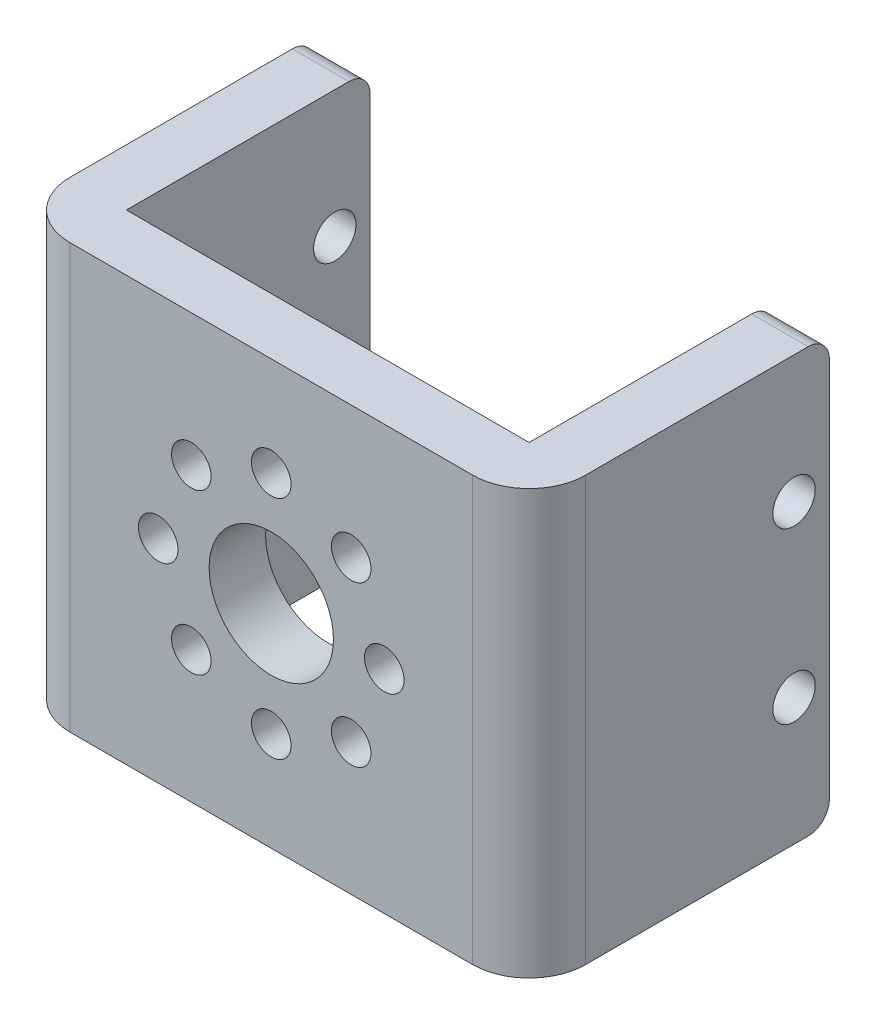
ISO-10303-21;
HEADER;
FILE_DESCRIPTION(('STEP AP214'),'2;1');
FILE_NAME('part.step','',(''),(''),'','','');
FILE_SCHEMA(('AUTOMOTIVE_DESIGN { 1 0 10303 214 1 1 1 1 }'));
ENDSEC;
DATA;
#1=APPLICATION_CONTEXT('core data for automotive mechanical design processes');
#2=APPLICATION_PROTOCOL_DEFINITION('international standard','automotive_design',2000,#1);
#3=PRODUCT_CONTEXT('',#1,'mechanical');
#4=PRODUCT('Part','Part','',(#3));
#5=PRODUCT_RELATED_PRODUCT_CATEGORY('part','',(#4));
#6=PRODUCT_DEFINITION_FORMATION('','',#4);
#7=PRODUCT_DEFINITION_CONTEXT('part definition',#1,'design');
#8=PRODUCT_DEFINITION('design','',#6,#7);
#9=PRODUCT_DEFINITION_SHAPE('','',#8);
#10=(LENGTH_UNIT() NAMED_UNIT(*) SI_UNIT(.MILLI.,.METRE.));
#11=(NAMED_UNIT(*) PLANE_ANGLE_UNIT() SI_UNIT($,.RADIAN.));
#12=(NAMED_UNIT(*) SI_UNIT($,.STERADIAN.) SOLID_ANGLE_UNIT());
#13=UNCERTAINTY_MEASURE_WITH_UNIT(LENGTH_MEASURE(1.E-05),#10,'distance_accuracy_value','');
#14=(GEOMETRIC_REPRESENTATION_CONTEXT(3) GLOBAL_UNCERTAINTY_ASSIGNED_CONTEXT((#13)) GLOBAL_UNIT_ASSIGNED_CONTEXT((#10,
#11,#12)) REPRESENTATION_CONTEXT('',''));
#15=CARTESIAN_POINT('',(0.,0.,0.));
#16=DIRECTION('',(0.,0.,1.));
#17=DIRECTION('',(1.,0.,0.));
#18=AXIS2_PLACEMENT_3D('',#15,#16,#17);
#19=CARTESIAN_POINT('',(14.25,0.,-1.5));
#20=DIRECTION('',(0.,1.,0.));
#21=DIRECTION('',(0.,0.,1.));
#22=AXIS2_PLACEMENT_3D('',#19,#20,#21);
#23=CYLINDRICAL_SURFACE('',#22,4.);
#24=CARTESIAN_POINT('',(14.25,-15.,-1.5));
#25=DIRECTION('',(0.,-1.,0.));
#26=DIRECTION('',(0.,0.,-1.));
#27=AXIS2_PLACEMENT_3D('',#24,#25,#26);
#28=CIRCLE('',#27,4.);
#29=CARTESIAN_POINT('',(18.25,-15.,-1.5));
#30=VERTEX_POINT('',#29);
#31=CARTESIAN_POINT('',(14.25,-15.,2.5));
#32=VERTEX_POINT('',#31);
#33=EDGE_CURVE('E197',#30,#32,#28,.T.);
#34=ORIENTED_EDGE('',*,*,#33,.F.);
#35=DIRECTION('',(0.,-1.,0.));
#36=VECTOR('',#35,1.);
#37=CARTESIAN_POINT('',(18.25,-13.5,-1.5));
#38=LINE('',#37,#36);
#39=CARTESIAN_POINT('',(18.25,15.,-1.5));
#40=VERTEX_POINT('',#39);
#41=EDGE_CURVE('E235',#40,#30,#38,.T.);
#42=ORIENTED_EDGE('',*,*,#41,.F.);
#43=CARTESIAN_POINT('',(14.25,15.,-1.5));
#44=DIRECTION('',(0.,1.,0.));
#45=DIRECTION('',(0.,0.,1.));
#46=AXIS2_PLACEMENT_3D('',#43,#44,#45);
#47=CIRCLE('',#46,4.);
#48=CARTESIAN_POINT('',(14.25,15.,2.5));
#49=VERTEX_POINT('',#48);
#50=EDGE_CURVE('E211',#49,#40,#47,.T.);
#51=ORIENTED_EDGE('',*,*,#50,.F.);
#52=DIRECTION('',(0.,1.,0.));
#53=VECTOR('',#52,1.);
#54=CARTESIAN_POINT('',(14.25,0.,2.5));
#55=LINE('',#54,#53);
#56=EDGE_CURVE('E11',#32,#49,#55,.T.);
#57=ORIENTED_EDGE('',*,*,#56,.F.);
#58=EDGE_LOOP('',(#34,#42,#51,#57));
#59=FACE_BOUND('',#58,.T.);
#60=ADVANCED_FACE('F17',(#59),#23,.T.);
#61=CARTESIAN_POINT('',(-14.25,0.,-1.5));
#62=DIRECTION('',(0.,-1.,0.));
#63=DIRECTION('',(0.,0.,-1.));
#64=AXIS2_PLACEMENT_3D('',#61,#62,#63);
#65=CYLINDRICAL_SURFACE('',#64,4.);
#66=CARTESIAN_POINT('',(-14.25,15.,-1.5));
#67=DIRECTION('',(0.,1.,0.));
#68=DIRECTION('',(0.,0.,1.));
#69=AXIS2_PLACEMENT_3D('',#66,#67,#68);
#70=CIRCLE('',#69,4.);
#71=CARTESIAN_POINT('',(-18.25,15.,-1.5));
#72=VERTEX_POINT('',#71);
#73=CARTESIAN_POINT('',(-14.25,15.,2.5));
#74=VERTEX_POINT('',#73);
#75=EDGE_CURVE('E206',#72,#74,#70,.T.);
#76=ORIENTED_EDGE('',*,*,#75,.F.);
#77=DIRECTION('',(0.,1.,0.));
#78=VECTOR('',#77,1.);
#79=CARTESIAN_POINT('',(-18.25,13.5,-1.5));
#80=LINE('',#79,#78);
#81=CARTESIAN_POINT('',(-18.25,-15.,-1.5));
#82=VERTEX_POINT('',#81);
#83=EDGE_CURVE('E238',#82,#72,#80,.T.);
#84=ORIENTED_EDGE('',*,*,#83,.F.);
#85=CARTESIAN_POINT('',(-14.25,-15.,-1.5));
#86=DIRECTION('',(0.,-1.,0.));
#87=DIRECTION('',(0.,0.,-1.));
#88=AXIS2_PLACEMENT_3D('',#85,#86,#87);
#89=CIRCLE('',#88,4.);
#90=CARTESIAN_POINT('',(-14.25,-15.,2.5));
#91=VERTEX_POINT('',#90);
#92=EDGE_CURVE('E184',#91,#82,#89,.T.);
#93=ORIENTED_EDGE('',*,*,#92,.F.);
#94=DIRECTION('',(0.,-1.,0.));
#95=VECTOR('',#94,1.);
#96=CARTESIAN_POINT('',(-14.25,0.,2.5));
#97=LINE('',#96,#95);
#98=EDGE_CURVE('E20',#74,#91,#97,.T.);
#99=ORIENTED_EDGE('',*,*,#98,.F.);
#100=EDGE_LOOP('',(#76,#84,#93,#99));
#101=FACE_BOUND('',#100,.T.);
#102=ADVANCED_FACE('F285',(#101),#65,.T.);
#103=CARTESIAN_POINT('',(0.,0.,2.5));
#104=DIRECTION('',(0.,0.,1.));
#105=DIRECTION('',(1.,0.,0.));
#106=AXIS2_PLACEMENT_3D('',#103,#104,#105);
#107=PLANE('',#106);
#108=CARTESIAN_POINT('',(0.,8.,2.5));
#109=DIRECTION('',(0.,0.,-1.));
#110=DIRECTION('',(1.,0.,0.));
#111=AXIS2_PLACEMENT_3D('',#108,#109,#110);
#112=CIRCLE('',#111,1.4);
#113=CARTESIAN_POINT('',(1.4,8.,2.5));
#114=VERTEX_POINT('',#113);
#115=EDGE_CURVE('E396',#114,#114,#112,.T.);
#116=ORIENTED_EDGE('',*,*,#115,.T.);
#117=EDGE_LOOP('',(#116));
#118=FACE_BOUND('',#117,.T.);
#119=CARTESIAN_POINT('',(-8.,0.,2.5));
#120=DIRECTION('',(0.,0.,-1.));
#121=DIRECTION('',(1.,0.,0.));
#122=AXIS2_PLACEMENT_3D('',#119,#120,#121);
#123=CIRCLE('',#122,1.4);
#124=CARTESIAN_POINT('',(-6.6,0.,2.5));
#125=VERTEX_POINT('',#124);
#126=EDGE_CURVE('E366',#125,#125,#123,.T.);
#127=ORIENTED_EDGE('',*,*,#126,.T.);
#128=EDGE_LOOP('',(#127));
#129=FACE_BOUND('',#128,.T.);
#130=CARTESIAN_POINT('',(0.,0.,2.5));
#131=DIRECTION('',(0.,0.,-1.));
#132=DIRECTION('',(1.,0.,0.));
#133=AXIS2_PLACEMENT_3D('',#130,#131,#132);
#134=CIRCLE('',#133,4.4);
#135=CARTESIAN_POINT('',(4.4,0.,2.5));
#136=VERTEX_POINT('',#135);
#137=EDGE_CURVE('E358',#136,#136,#134,.T.);
#138=ORIENTED_EDGE('',*,*,#137,.T.);
#139=EDGE_LOOP('',(#138));
#140=FACE_BOUND('',#139,.T.);
#141=CARTESIAN_POINT('',(8.,0.,2.5));
#142=DIRECTION('',(0.,0.,-1.));
#143=DIRECTION('',(1.,0.,0.));
#144=AXIS2_PLACEMENT_3D('',#141,#142,#143);
#145=CIRCLE('',#144,1.4);
#146=CARTESIAN_POINT('',(9.4,0.,2.5));
#147=VERTEX_POINT('',#146);
#148=EDGE_CURVE('E338',#147,#147,#145,.T.);
#149=ORIENTED_EDGE('',*,*,#148,.T.);
#150=EDGE_LOOP('',(#149));
#151=FACE_BOUND('',#150,.T.);
#152=CARTESIAN_POINT('',(5.656854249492,-5.656854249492,2.5));
#153=DIRECTION('',(0.,0.,-1.));
#154=DIRECTION('',(1.,0.,0.));
#155=AXIS2_PLACEMENT_3D('',#152,#153,#154);
#156=CIRCLE('',#155,1.4);
#157=CARTESIAN_POINT('',(7.056854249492,-5.656854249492,2.5));
#158=VERTEX_POINT('',#157);
#159=EDGE_CURVE('E348',#158,#158,#156,.T.);
#160=ORIENTED_EDGE('',*,*,#159,.T.);
#161=EDGE_LOOP('',(#160));
#162=FACE_BOUND('',#161,.T.);
#163=CARTESIAN_POINT('',(-5.656854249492,5.656854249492,2.5));
#164=DIRECTION('',(0.,0.,-1.));
#165=DIRECTION('',(1.,0.,0.));
#166=AXIS2_PLACEMENT_3D('',#163,#164,#165);
#167=CIRCLE('',#166,1.4);
#168=CARTESIAN_POINT('',(-4.256854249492,5.656854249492,2.5));
#169=VERTEX_POINT('',#168);
#170=EDGE_CURVE('E380',#169,#169,#167,.T.);
#171=ORIENTED_EDGE('',*,*,#170,.T.);
#172=EDGE_LOOP('',(#171));
#173=FACE_BOUND('',#172,.T.);
#174=CARTESIAN_POINT('',(5.656854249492,5.656854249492,2.5));
#175=DIRECTION('',(0.,0.,-1.));
#176=DIRECTION('',(1.,0.,0.));
#177=AXIS2_PLACEMENT_3D('',#174,#175,#176);
#178=CIRCLE('',#177,1.4);
#179=CARTESIAN_POINT('',(7.056854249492,5.656854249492,2.5));
#180=VERTEX_POINT('',#179);
#181=EDGE_CURVE('E391',#180,#180,#178,.T.);
#182=ORIENTED_EDGE('',*,*,#181,.T.);
#183=EDGE_LOOP('',(#182));
#184=FACE_BOUND('',#183,.T.);
#185=CARTESIAN_POINT('',(0.,-8.,2.5));
#186=DIRECTION('',(0.,0.,-1.));
#187=DIRECTION('',(1.,0.,0.));
#188=AXIS2_PLACEMENT_3D('',#185,#186,#187);
#189=CIRCLE('',#188,1.4);
#190=CARTESIAN_POINT('',(1.4,-8.,2.5));
#191=VERTEX_POINT('',#190);
#192=EDGE_CURVE('E404',#191,#191,#189,.T.);
#193=ORIENTED_EDGE('',*,*,#192,.T.);
#194=EDGE_LOOP('',(#193));
#195=FACE_BOUND('',#194,.T.);
#196=CARTESIAN_POINT('',(-5.656854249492,-5.656854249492,2.5));
#197=DIRECTION('',(0.,0.,-1.));
#198=DIRECTION('',(1.,0.,0.));
#199=AXIS2_PLACEMENT_3D('',#196,#197,#198);
#200=CIRCLE('',#199,1.4);
#201=CARTESIAN_POINT('',(-4.256854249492,-5.656854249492,2.5));
#202=VERTEX_POINT('',#201);
#203=EDGE_CURVE('E421',#202,#202,#200,.T.);
#204=ORIENTED_EDGE('',*,*,#203,.T.);
#205=EDGE_LOOP('',(#204));
#206=FACE_BOUND('',#205,.T.);
#207=DIRECTION('',(-1.,0.,0.));
#208=VECTOR('',#207,1.);
#209=CARTESIAN_POINT('',(0.,15.,2.5));
#210=LINE('',#209,#208);
#211=EDGE_CURVE('E210',#49,#74,#210,.T.);
#212=ORIENTED_EDGE('',*,*,#211,.T.);
#213=ORIENTED_EDGE('',*,*,#98,.T.);
#214=DIRECTION('',(1.,0.,0.));
#215=VECTOR('',#214,1.);
#216=CARTESIAN_POINT('',(0.,-15.,2.5));
#217=LINE('',#216,#215);
#218=EDGE_CURVE('E282',#91,#32,#217,.T.);
#219=ORIENTED_EDGE('',*,*,#218,.T.);
#220=ORIENTED_EDGE('',*,*,#56,.T.);
#221=EDGE_LOOP('',(#212,#213,#219,#220));
#222=FACE_BOUND('',#221,.T.);
#223=ADVANCED_FACE('F281',(#118,#129,#140,#151,#162,#173,#184,#195,#206,#222),#107,.T.);
#224=CARTESIAN_POINT('',(-18.25,13.5,-17.25));
#225=DIRECTION('',(-1.,0.,0.));
#226=DIRECTION('',(0.,0.,1.));
#227=AXIS2_PLACEMENT_3D('',#224,#225,#226);
#228=PLANE('',#227);
#229=CARTESIAN_POINT('',(-18.25,-6.,-16.25));
#230=DIRECTION('',(-1.,0.,0.));
#231=DIRECTION('',(0.,0.,1.));
#232=AXIS2_PLACEMENT_3D('',#229,#230,#231);
#233=CIRCLE('',#232,1.5);
#234=CARTESIAN_POINT('',(-18.25,-6.,-14.75));
#235=VERTEX_POINT('',#234);
#236=EDGE_CURVE('E328',#235,#235,#233,.T.);
#237=ORIENTED_EDGE('',*,*,#236,.F.);
#238=EDGE_LOOP('',(#237));
#239=FACE_BOUND('',#238,.T.);
#240=CARTESIAN_POINT('',(-18.25,6.,-16.25));
#241=DIRECTION('',(-1.,0.,0.));
#242=DIRECTION('',(0.,0.,1.));
#243=AXIS2_PLACEMENT_3D('',#240,#241,#242);
#244=CIRCLE('',#243,1.5);
#245=CARTESIAN_POINT('',(-18.25,6.,-14.75));
#246=VERTEX_POINT('',#245);
#247=EDGE_CURVE('E320',#246,#246,#244,.T.);
#248=ORIENTED_EDGE('',*,*,#247,.F.);
#249=EDGE_LOOP('',(#248));
#250=FACE_BOUND('',#249,.T.);
#251=DIRECTION('',(0.,0.,1.));
#252=VECTOR('',#251,1.);
#253=CARTESIAN_POINT('',(-18.25,-15.,-17.25));
#254=LINE('',#253,#252);
#255=CARTESIAN_POINT('',(-18.25,-15.,-17.25));
#256=VERTEX_POINT('',#255);
#257=EDGE_CURVE('E177',#256,#82,#254,.T.);
#258=ORIENTED_EDGE('',*,*,#257,.T.);
#259=ORIENTED_EDGE('',*,*,#83,.T.);
#260=DIRECTION('',(0.,0.,-1.));
#261=VECTOR('',#260,1.);
#262=CARTESIAN_POINT('',(-18.25,15.,0.));
#263=LINE('',#262,#261);
#264=CARTESIAN_POINT('',(-18.25,15.,-17.25));
#265=VERTEX_POINT('',#264);
#266=EDGE_CURVE('E202',#72,#265,#263,.T.);
#267=ORIENTED_EDGE('',*,*,#266,.T.);
#268=CARTESIAN_POINT('',(-18.25,13.5,-17.25));
#269=DIRECTION('',(-1.,0.,0.));
#270=DIRECTION('',(0.,0.,1.));
#271=AXIS2_PLACEMENT_3D('',#268,#269,#270);
#272=CIRCLE('',#271,1.5);
#273=CARTESIAN_POINT('',(-18.25,13.5,-18.75));
#274=VERTEX_POINT('',#273);
#275=EDGE_CURVE('E259',#265,#274,#272,.T.);
#276=ORIENTED_EDGE('',*,*,#275,.T.);
#277=DIRECTION('',(0.,-1.,0.));
#278=VECTOR('',#277,1.);
#279=CARTESIAN_POINT('',(-18.25,13.5,-18.75));
#280=LINE('',#279,#278);
#281=CARTESIAN_POINT('',(-18.25,-13.5,-18.75));
#282=VERTEX_POINT('',#281);
#283=EDGE_CURVE('E265',#274,#282,#280,.T.);
#284=ORIENTED_EDGE('',*,*,#283,.T.);
#285=CARTESIAN_POINT('',(-18.25,-13.5,-17.25));
#286=DIRECTION('',(-1.,0.,0.));
#287=DIRECTION('',(0.,0.,1.));
#288=AXIS2_PLACEMENT_3D('',#285,#286,#287);
#289=CIRCLE('',#288,1.5);
#290=EDGE_CURVE('E41',#282,#256,#289,.T.);
#291=ORIENTED_EDGE('',*,*,#290,.T.);
#292=EDGE_LOOP('',(#258,#259,#267,#276,#284,#291));
#293=FACE_BOUND('',#292,.T.);
#294=ADVANCED_FACE('F461',(#239,#250,#293),#228,.T.);
#295=CARTESIAN_POINT('',(18.25,-13.5,-17.25));
#296=DIRECTION('',(1.,0.,0.));
#297=DIRECTION('',(0.,1.,0.));
#298=AXIS2_PLACEMENT_3D('',#295,#296,#297);
#299=PLANE('',#298);
#300=CARTESIAN_POINT('',(18.25,6.,-16.25));
#301=DIRECTION('',(1.,0.,0.));
#302=DIRECTION('',(0.,0.,-1.));
#303=AXIS2_PLACEMENT_3D('',#300,#301,#302);
#304=CIRCLE('',#303,1.5);
#305=CARTESIAN_POINT('',(18.25,6.,-17.75));
#306=VERTEX_POINT('',#305);
#307=EDGE_CURVE('E304',#306,#306,#304,.T.);
#308=ORIENTED_EDGE('',*,*,#307,.F.);
#309=EDGE_LOOP('',(#308));
#310=FACE_BOUND('',#309,.T.);
#311=CARTESIAN_POINT('',(18.25,-6.,-16.25));
#312=DIRECTION('',(1.,0.,0.));
#313=DIRECTION('',(0.,0.,-1.));
#314=AXIS2_PLACEMENT_3D('',#311,#312,#313);
#315=CIRCLE('',#314,1.5);
#316=CARTESIAN_POINT('',(18.25,-6.,-17.75));
#317=VERTEX_POINT('',#316);
#318=EDGE_CURVE('E290',#317,#317,#315,.T.);
#319=ORIENTED_EDGE('',*,*,#318,.F.);
#320=EDGE_LOOP('',(#319));
#321=FACE_BOUND('',#320,.T.);
#322=DIRECTION('',(0.,0.,1.));
#323=VECTOR('',#322,1.);
#324=CARTESIAN_POINT('',(18.25,15.,-17.25));
#325=LINE('',#324,#323);
#326=CARTESIAN_POINT('',(18.25,15.,-17.25));
#327=VERTEX_POINT('',#326);
#328=EDGE_CURVE('E215',#327,#40,#325,.T.);
#329=ORIENTED_EDGE('',*,*,#328,.T.);
#330=ORIENTED_EDGE('',*,*,#41,.T.);
#331=DIRECTION('',(0.,0.,-1.));
#332=VECTOR('',#331,1.);
#333=CARTESIAN_POINT('',(18.25,-15.,0.));
#334=LINE('',#333,#332);
#335=CARTESIAN_POINT('',(18.25,-15.,-17.25));
#336=VERTEX_POINT('',#335);
#337=EDGE_CURVE('E193',#30,#336,#334,.T.);
#338=ORIENTED_EDGE('',*,*,#337,.T.);
#339=CARTESIAN_POINT('',(18.25,-13.5,-17.25));
#340=DIRECTION('',(1.,0.,0.));
#341=DIRECTION('',(0.,0.,-1.));
#342=AXIS2_PLACEMENT_3D('',#339,#340,#341);
#343=CIRCLE('',#342,1.5);
#344=CARTESIAN_POINT('',(18.25,-13.5,-18.75));
#345=VERTEX_POINT('',#344);
#346=EDGE_CURVE('E254',#336,#345,#343,.T.);
#347=ORIENTED_EDGE('',*,*,#346,.T.);
#348=DIRECTION('',(0.,1.,0.));
#349=VECTOR('',#348,1.);
#350=CARTESIAN_POINT('',(18.25,-13.5,-18.75));
#351=LINE('',#350,#349);
#352=CARTESIAN_POINT('',(18.25,13.5,-18.75));
#353=VERTEX_POINT('',#352);
#354=EDGE_CURVE('E250',#345,#353,#351,.T.);
#355=ORIENTED_EDGE('',*,*,#354,.T.);
#356=CARTESIAN_POINT('',(18.25,13.5,-17.25));
#357=DIRECTION('',(1.,0.,0.));
#358=DIRECTION('',(0.,0.,-1.));
#359=AXIS2_PLACEMENT_3D('',#356,#357,#358);
#360=CIRCLE('',#359,1.5);
#361=EDGE_CURVE('E253',#353,#327,#360,.T.);
#362=ORIENTED_EDGE('',*,*,#361,.T.);
#363=EDGE_LOOP('',(#329,#330,#338,#347,#355,#362));
#364=FACE_BOUND('',#363,.T.);
#365=ADVANCED_FACE('F453',(#310,#321,#364),#299,.T.);
#366=CARTESIAN_POINT('',(-50.355815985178,-13.5,-17.25));
#367=DIRECTION('',(1.,0.,0.));
#368=DIRECTION('',(0.,0.,-1.));
#369=AXIS2_PLACEMENT_3D('',#366,#367,#368);
#370=CYLINDRICAL_SURFACE('',#369,1.5);
#371=DIRECTION('',(1.,0.,0.));
#372=VECTOR('',#371,1.);
#373=CARTESIAN_POINT('',(-50.355815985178,-15.,-17.25));
#374=LINE('',#373,#372);
#375=CARTESIAN_POINT('',(-14.25,-15.,-17.25));
#376=VERTEX_POINT('',#375);
#377=EDGE_CURVE('E152',#256,#376,#374,.T.);
#378=ORIENTED_EDGE('',*,*,#377,.F.);
#379=ORIENTED_EDGE('',*,*,#290,.F.);
#380=DIRECTION('',(1.,0.,0.));
#381=VECTOR('',#380,1.);
#382=CARTESIAN_POINT('',(-50.355815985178,-13.5,-18.75));
#383=LINE('',#382,#381);
#384=CARTESIAN_POINT('',(-14.25,-13.5,-18.75));
#385=VERTEX_POINT('',#384);
#386=EDGE_CURVE('E155',#282,#385,#383,.T.);
#387=ORIENTED_EDGE('',*,*,#386,.T.);
#388=CARTESIAN_POINT('',(-14.25,-13.5,-17.25));
#389=DIRECTION('',(1.,0.,0.));
#390=DIRECTION('',(0.,0.,-1.));
#391=AXIS2_PLACEMENT_3D('',#388,#389,#390);
#392=CIRCLE('',#391,1.5);
#393=EDGE_CURVE('E148',#376,#385,#392,.T.);
#394=ORIENTED_EDGE('',*,*,#393,.F.);
#395=EDGE_LOOP('',(#378,#379,#387,#394));
#396=FACE_BOUND('',#395,.T.);
#397=ADVANCED_FACE('F150',(#396),#370,.T.);
#398=CARTESIAN_POINT('',(-50.355815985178,-13.5,-18.75));
#399=DIRECTION('',(0.,0.,-1.));
#400=DIRECTION('',(0.,-1.,0.));
#401=AXIS2_PLACEMENT_3D('',#398,#399,#400);
#402=PLANE('',#401);
#403=ORIENTED_EDGE('',*,*,#386,.F.);
#404=ORIENTED_EDGE('',*,*,#283,.F.);
#405=DIRECTION('',(1.,0.,0.));
#406=VECTOR('',#405,1.);
#407=CARTESIAN_POINT('',(-50.355815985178,13.5,-18.75));
#408=LINE('',#407,#406);
#409=CARTESIAN_POINT('',(-14.25,13.5,-18.75));
#410=VERTEX_POINT('',#409);
#411=EDGE_CURVE('E258',#274,#410,#408,.T.);
#412=ORIENTED_EDGE('',*,*,#411,.T.);
#413=DIRECTION('',(0.,1.,0.));
#414=VECTOR('',#413,1.);
#415=CARTESIAN_POINT('',(-14.25,-13.5,-18.75));
#416=LINE('',#415,#414);
#417=EDGE_CURVE('E160',#385,#410,#416,.T.);
#418=ORIENTED_EDGE('',*,*,#417,.F.);
#419=EDGE_LOOP('',(#403,#404,#412,#418));
#420=FACE_BOUND('',#419,.T.);
#421=ADVANCED_FACE('F970',(#420),#402,.T.);
#422=CARTESIAN_POINT('',(-50.355815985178,13.5,-17.25));
#423=DIRECTION('',(1.,0.,0.));
#424=DIRECTION('',(0.,0.,-1.));
#425=AXIS2_PLACEMENT_3D('',#422,#423,#424);
#426=CYLINDRICAL_SURFACE('',#425,1.5);
#427=ORIENTED_EDGE('',*,*,#411,.F.);
#428=ORIENTED_EDGE('',*,*,#275,.F.);
#429=DIRECTION('',(1.,0.,0.));
#430=VECTOR('',#429,1.);
#431=CARTESIAN_POINT('',(-50.355815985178,15.,-17.25));
#432=LINE('',#431,#430);
#433=CARTESIAN_POINT('',(-14.25,15.,-17.25));
#434=VERTEX_POINT('',#433);
#435=EDGE_CURVE('E223',#265,#434,#432,.T.);
#436=ORIENTED_EDGE('',*,*,#435,.T.);
#437=CARTESIAN_POINT('',(-14.25,13.5,-17.25));
#438=DIRECTION('',(1.,0.,0.));
#439=DIRECTION('',(0.,0.,-1.));
#440=AXIS2_PLACEMENT_3D('',#437,#438,#439);
#441=CIRCLE('',#440,1.5);
#442=EDGE_CURVE('E227',#410,#434,#441,.T.);
#443=ORIENTED_EDGE('',*,*,#442,.F.);
#444=EDGE_LOOP('',(#427,#428,#436,#443));
#445=FACE_BOUND('',#444,.T.);
#446=ADVANCED_FACE('F1042',(#445),#426,.T.);
#447=CARTESIAN_POINT('',(15.75,-13.5,-17.25));
#448=DIRECTION('',(1.,0.,0.));
#449=DIRECTION('',(0.,0.,-1.));
#450=AXIS2_PLACEMENT_3D('',#447,#448,#449);
#451=CYLINDRICAL_SURFACE('',#450,1.5);
#452=CARTESIAN_POINT('',(14.25,-13.5,-17.25));
#453=DIRECTION('',(-1.,0.,0.));
#454=DIRECTION('',(0.,0.,-1.));
#455=AXIS2_PLACEMENT_3D('',#452,#453,#454);
#456=CIRCLE('',#455,1.5);
#457=CARTESIAN_POINT('',(14.25,-13.5,-18.75));
#458=VERTEX_POINT('',#457);
#459=CARTESIAN_POINT('',(14.25,-15.,-17.25));
#460=VERTEX_POINT('',#459);
#461=EDGE_CURVE('E243',#458,#460,#456,.T.);
#462=ORIENTED_EDGE('',*,*,#461,.F.);
#463=DIRECTION('',(-1.,0.,0.));
#464=VECTOR('',#463,1.);
#465=CARTESIAN_POINT('',(-18.6681181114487,-13.5,-18.75));
#466=LINE('',#465,#464);
#467=EDGE_CURVE('E139',#345,#458,#466,.T.);
#468=ORIENTED_EDGE('',*,*,#467,.F.);
#469=ORIENTED_EDGE('',*,*,#346,.F.);
#470=DIRECTION('',(1.,0.,0.));
#471=VECTOR('',#470,1.);
#472=CARTESIAN_POINT('',(15.75,-15.,-17.25));
#473=LINE('',#472,#471);
#474=EDGE_CURVE('E198',#460,#336,#473,.T.);
#475=ORIENTED_EDGE('',*,*,#474,.F.);
#476=EDGE_LOOP('',(#462,#468,#469,#475));
#477=FACE_BOUND('',#476,.T.);
#478=ADVANCED_FACE('F451',(#477),#451,.T.);
#479=CARTESIAN_POINT('',(-18.6681181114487,13.5,-17.25));
#480=DIRECTION('',(1.,0.,0.));
#481=DIRECTION('',(0.,0.,-1.));
#482=AXIS2_PLACEMENT_3D('',#479,#480,#481);
#483=CYLINDRICAL_SURFACE('',#482,1.5);
#484=CARTESIAN_POINT('',(14.25,13.5,-17.25));
#485=DIRECTION('',(-1.,0.,0.));
#486=DIRECTION('',(0.,0.,-1.));
#487=AXIS2_PLACEMENT_3D('',#484,#485,#486);
#488=CIRCLE('',#487,1.5);
#489=CARTESIAN_POINT('',(14.25,15.,-17.25));
#490=VERTEX_POINT('',#489);
#491=CARTESIAN_POINT('',(14.25,13.5,-18.75));
#492=VERTEX_POINT('',#491);
#493=EDGE_CURVE('E244',#490,#492,#488,.T.);
#494=ORIENTED_EDGE('',*,*,#493,.F.);
#495=DIRECTION('',(-1.,0.,0.));
#496=VECTOR('',#495,1.);
#497=CARTESIAN_POINT('',(-15.75,15.,-17.25));
#498=LINE('',#497,#496);
#499=EDGE_CURVE('E216',#327,#490,#498,.T.);
#500=ORIENTED_EDGE('',*,*,#499,.F.);
#501=ORIENTED_EDGE('',*,*,#361,.F.);
#502=DIRECTION('',(1.,0.,0.));
#503=VECTOR('',#502,1.);
#504=CARTESIAN_POINT('',(-18.6681181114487,13.5,-18.75));
#505=LINE('',#504,#503);
#506=EDGE_CURVE('E127',#492,#353,#505,.T.);
#507=ORIENTED_EDGE('',*,*,#506,.F.);
#508=EDGE_LOOP('',(#494,#500,#501,#507));
#509=FACE_BOUND('',#508,.T.);
#510=ADVANCED_FACE('F1020',(#509),#483,.T.);
#511=CARTESIAN_POINT('',(-18.6681181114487,0.,-18.75));
#512=DIRECTION('',(0.,0.,-1.));
#513=DIRECTION('',(0.,-1.,0.));
#514=AXIS2_PLACEMENT_3D('',#511,#512,#513);
#515=PLANE('',#514);
#516=DIRECTION('',(0.,-1.,0.));
#517=VECTOR('',#516,1.);
#518=CARTESIAN_POINT('',(14.25,0.,-18.75));
#519=LINE('',#518,#517);
#520=EDGE_CURVE('E239',#492,#458,#519,.T.);
#521=ORIENTED_EDGE('',*,*,#520,.F.);
#522=ORIENTED_EDGE('',*,*,#506,.T.);
#523=ORIENTED_EDGE('',*,*,#354,.F.);
#524=ORIENTED_EDGE('',*,*,#467,.T.);
#525=EDGE_LOOP('',(#521,#522,#523,#524));
#526=FACE_BOUND('',#525,.T.);
#527=ADVANCED_FACE('F1011',(#526),#515,.T.);
#528=CARTESIAN_POINT('',(14.25,15.,-15.25));
#529=DIRECTION('',(1.,0.,0.));
#530=DIRECTION('',(0.,1.,0.));
#531=AXIS2_PLACEMENT_3D('',#528,#529,#530);
#532=PLANE('',#531);
#533=CARTESIAN_POINT('',(14.25,-6.,-16.25));
#534=DIRECTION('',(1.,0.,0.));
#535=DIRECTION('',(0.,0.,-1.));
#536=AXIS2_PLACEMENT_3D('',#533,#534,#535);
#537=CIRCLE('',#536,1.5);
#538=CARTESIAN_POINT('',(14.25,-6.,-17.75));
#539=VERTEX_POINT('',#538);
#540=EDGE_CURVE('E297',#539,#539,#537,.T.);
#541=ORIENTED_EDGE('',*,*,#540,.T.);
#542=EDGE_LOOP('',(#541));
#543=FACE_BOUND('',#542,.T.);
#544=CARTESIAN_POINT('',(14.25,6.,-16.25));
#545=DIRECTION('',(1.,0.,0.));
#546=DIRECTION('',(0.,0.,-1.));
#547=AXIS2_PLACEMENT_3D('',#544,#545,#546);
#548=CIRCLE('',#547,1.5);
#549=CARTESIAN_POINT('',(14.25,6.,-17.75));
#550=VERTEX_POINT('',#549);
#551=EDGE_CURVE('E308',#550,#550,#548,.T.);
#552=ORIENTED_EDGE('',*,*,#551,.T.);
#553=EDGE_LOOP('',(#552));
#554=FACE_BOUND('',#553,.T.);
#555=DIRECTION('',(0.,0.,1.));
#556=VECTOR('',#555,1.);
#557=CARTESIAN_POINT('',(14.25,15.,-15.25));
#558=LINE('',#557,#556);
#559=CARTESIAN_POINT('',(14.25,15.,-1.5));
#560=VERTEX_POINT('',#559);
#561=EDGE_CURVE('E191',#490,#560,#558,.T.);
#562=ORIENTED_EDGE('',*,*,#561,.F.);
#563=ORIENTED_EDGE('',*,*,#493,.T.);
#564=ORIENTED_EDGE('',*,*,#520,.T.);
#565=ORIENTED_EDGE('',*,*,#461,.T.);
#566=DIRECTION('',(0.,0.,1.));
#567=VECTOR('',#566,1.);
#568=CARTESIAN_POINT('',(14.25,-15.,-15.25));
#569=LINE('',#568,#567);
#570=CARTESIAN_POINT('',(14.25,-15.,-1.5));
#571=VERTEX_POINT('',#570);
#572=EDGE_CURVE('E300',#460,#571,#569,.T.);
#573=ORIENTED_EDGE('',*,*,#572,.T.);
#574=DIRECTION('',(0.,-1.,0.));
#575=VECTOR('',#574,1.);
#576=CARTESIAN_POINT('',(14.25,15.,-1.5));
#577=LINE('',#576,#575);
#578=EDGE_CURVE('E234',#560,#571,#577,.T.);
#579=ORIENTED_EDGE('',*,*,#578,.F.);
#580=EDGE_LOOP('',(#562,#563,#564,#565,#573,#579));
#581=FACE_BOUND('',#580,.T.);
#582=ADVANCED_FACE('F439',(#543,#554,#581),#532,.F.);
#583=CARTESIAN_POINT('',(14.25,15.,-1.5));
#584=DIRECTION('',(0.,0.,1.));
#585=DIRECTION('',(1.,0.,0.));
#586=AXIS2_PLACEMENT_3D('',#583,#584,#585);
#587=PLANE('',#586);
#588=CARTESIAN_POINT('',(8.,0.,-1.5));
#589=DIRECTION('',(0.,0.,-1.));
#590=DIRECTION('',(-1.,0.,0.));
#591=AXIS2_PLACEMENT_3D('',#588,#589,#590);
#592=CIRCLE('',#591,1.4);
#593=CARTESIAN_POINT('',(6.6,0.,-1.5));
#594=VERTEX_POINT('',#593);
#595=EDGE_CURVE('E333',#594,#594,#592,.T.);
#596=ORIENTED_EDGE('',*,*,#595,.F.);
#597=EDGE_LOOP('',(#596));
#598=FACE_BOUND('',#597,.T.);
#599=CARTESIAN_POINT('',(5.656854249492,-5.656854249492,-1.5));
#600=DIRECTION('',(0.,0.,-1.));
#601=DIRECTION('',(1.,0.,0.));
#602=AXIS2_PLACEMENT_3D('',#599,#600,#601);
#603=CIRCLE('',#602,1.4);
#604=CARTESIAN_POINT('',(7.056854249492,-5.656854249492,-1.5));
#605=VERTEX_POINT('',#604);
#606=EDGE_CURVE('E342',#605,#605,#603,.T.);
#607=ORIENTED_EDGE('',*,*,#606,.F.);
#608=EDGE_LOOP('',(#607));
#609=FACE_BOUND('',#608,.T.);
#610=CARTESIAN_POINT('',(0.,0.,-1.5));
#611=DIRECTION('',(0.,0.,-1.));
#612=DIRECTION('',(-1.,0.,0.));
#613=AXIS2_PLACEMENT_3D('',#610,#611,#612);
#614=CIRCLE('',#613,4.4);
#615=CARTESIAN_POINT('',(-4.4,0.,-1.5));
#616=VERTEX_POINT('',#615);
#617=EDGE_CURVE('E352',#616,#616,#614,.T.);
#618=ORIENTED_EDGE('',*,*,#617,.F.);
#619=EDGE_LOOP('',(#618));
#620=FACE_BOUND('',#619,.T.);
#621=CARTESIAN_POINT('',(-8.,0.,-1.5));
#622=DIRECTION('',(0.,0.,-1.));
#623=DIRECTION('',(1.,0.,0.));
#624=AXIS2_PLACEMENT_3D('',#621,#622,#623);
#625=CIRCLE('',#624,1.4);
#626=CARTESIAN_POINT('',(-6.6,0.,-1.5));
#627=VERTEX_POINT('',#626);
#628=EDGE_CURVE('E362',#627,#627,#625,.T.);
#629=ORIENTED_EDGE('',*,*,#628,.F.);
#630=EDGE_LOOP('',(#629));
#631=FACE_BOUND('',#630,.T.);
#632=CARTESIAN_POINT('',(-5.656854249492,5.656854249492,-1.5));
#633=DIRECTION('',(0.,0.,-1.));
#634=DIRECTION('',(1.,0.,0.));
#635=AXIS2_PLACEMENT_3D('',#632,#633,#634);
#636=CIRCLE('',#635,1.4);
#637=CARTESIAN_POINT('',(-4.256854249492,5.656854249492,-1.5));
#638=VERTEX_POINT('',#637);
#639=EDGE_CURVE('E373',#638,#638,#636,.T.);
#640=ORIENTED_EDGE('',*,*,#639,.F.);
#641=EDGE_LOOP('',(#640));
#642=FACE_BOUND('',#641,.T.);
#643=CARTESIAN_POINT('',(5.656854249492,5.656854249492,-1.5));
#644=DIRECTION('',(0.,0.,-1.));
#645=DIRECTION('',(-1.,0.,0.));
#646=AXIS2_PLACEMENT_3D('',#643,#644,#645);
#647=CIRCLE('',#646,1.4);
#648=CARTESIAN_POINT('',(4.256854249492,5.656854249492,-1.5));
#649=VERTEX_POINT('',#648);
#650=EDGE_CURVE('E387',#649,#649,#647,.T.);
#651=ORIENTED_EDGE('',*,*,#650,.F.);
#652=EDGE_LOOP('',(#651));
#653=FACE_BOUND('',#652,.T.);
#654=CARTESIAN_POINT('',(0.,8.,-1.5));
#655=DIRECTION('',(0.,0.,-1.));
#656=DIRECTION('',(-1.,0.,0.));
#657=AXIS2_PLACEMENT_3D('',#654,#655,#656);
#658=CIRCLE('',#657,1.4);
#659=CARTESIAN_POINT('',(-1.4,8.,-1.5));
#660=VERTEX_POINT('',#659);
#661=EDGE_CURVE('E395',#660,#660,#658,.T.);
#662=ORIENTED_EDGE('',*,*,#661,.F.);
#663=EDGE_LOOP('',(#662));
#664=FACE_BOUND('',#663,.T.);
#665=CARTESIAN_POINT('',(0.,-8.,-1.5));
#666=DIRECTION('',(0.,0.,-1.));
#667=DIRECTION('',(1.,0.,0.));
#668=AXIS2_PLACEMENT_3D('',#665,#666,#667);
#669=CIRCLE('',#668,1.4);
#670=CARTESIAN_POINT('',(1.4,-8.,-1.5));
#671=VERTEX_POINT('',#670);
#672=EDGE_CURVE('E400',#671,#671,#669,.T.);
#673=ORIENTED_EDGE('',*,*,#672,.F.);
#674=EDGE_LOOP('',(#673));
#675=FACE_BOUND('',#674,.T.);
#676=CARTESIAN_POINT('',(-5.656854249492,-5.656854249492,-1.5));
#677=DIRECTION('',(0.,0.,-1.));
#678=DIRECTION('',(-1.,0.,0.));
#679=AXIS2_PLACEMENT_3D('',#676,#677,#678);
#680=CIRCLE('',#679,1.4);
#681=CARTESIAN_POINT('',(-7.056854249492,-5.656854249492,-1.5));
#682=VERTEX_POINT('',#681);
#683=EDGE_CURVE('E408',#682,#682,#680,.T.);
#684=ORIENTED_EDGE('',*,*,#683,.F.);
#685=EDGE_LOOP('',(#684));
#686=FACE_BOUND('',#685,.T.);
#687=DIRECTION('',(-1.,0.,0.));
#688=VECTOR('',#687,1.);
#689=CARTESIAN_POINT('',(14.25,-15.,-1.5));
#690=LINE('',#689,#688);
#691=CARTESIAN_POINT('',(-14.25,-15.,-1.5));
#692=VERTEX_POINT('',#691);
#693=EDGE_CURVE('E171',#571,#692,#690,.T.);
#694=ORIENTED_EDGE('',*,*,#693,.T.);
#695=DIRECTION('',(0.,-1.,0.));
#696=VECTOR('',#695,1.);
#697=CARTESIAN_POINT('',(-14.25,15.,-1.5));
#698=LINE('',#697,#696);
#699=CARTESIAN_POINT('',(-14.25,15.,-1.5));
#700=VERTEX_POINT('',#699);
#701=EDGE_CURVE('E161',#700,#692,#698,.T.);
#702=ORIENTED_EDGE('',*,*,#701,.F.);
#703=DIRECTION('',(-1.,0.,0.));
#704=VECTOR('',#703,1.);
#705=CARTESIAN_POINT('',(14.25,15.,-1.5));
#706=LINE('',#705,#704);
#707=EDGE_CURVE('E188',#560,#700,#706,.T.);
#708=ORIENTED_EDGE('',*,*,#707,.F.);
#709=ORIENTED_EDGE('',*,*,#578,.T.);
#710=EDGE_LOOP('',(#694,#702,#708,#709));
#711=FACE_BOUND('',#710,.T.);
#712=ADVANCED_FACE('F436',(#598,#609,#620,#631,#642,#653,#664,#675,#686,#711),#587,.F.);
#713=CARTESIAN_POINT('',(-14.25,15.,-1.5));
#714=DIRECTION('',(-1.,0.,0.));
#715=DIRECTION('',(0.,0.,1.));
#716=AXIS2_PLACEMENT_3D('',#713,#714,#715);
#717=PLANE('',#716);
#718=CARTESIAN_POINT('',(-14.25,6.,-16.25));
#719=DIRECTION('',(-1.,0.,0.));
#720=DIRECTION('',(0.,0.,1.));
#721=AXIS2_PLACEMENT_3D('',#718,#719,#720);
#722=CIRCLE('',#721,1.5);
#723=CARTESIAN_POINT('',(-14.25,6.,-14.75));
#724=VERTEX_POINT('',#723);
#725=EDGE_CURVE('E323',#724,#724,#722,.T.);
#726=ORIENTED_EDGE('',*,*,#725,.T.);
#727=EDGE_LOOP('',(#726));
#728=FACE_BOUND('',#727,.T.);
#729=CARTESIAN_POINT('',(-14.25,-6.,-16.25));
#730=DIRECTION('',(-1.,0.,0.));
#731=DIRECTION('',(0.,0.,1.));
#732=AXIS2_PLACEMENT_3D('',#729,#730,#731);
#733=CIRCLE('',#732,1.5);
#734=CARTESIAN_POINT('',(-14.25,-6.,-14.75));
#735=VERTEX_POINT('',#734);
#736=EDGE_CURVE('E337',#735,#735,#733,.T.);
#737=ORIENTED_EDGE('',*,*,#736,.T.);
#738=EDGE_LOOP('',(#737));
#739=FACE_BOUND('',#738,.T.);
#740=ORIENTED_EDGE('',*,*,#442,.T.);
#741=DIRECTION('',(0.,0.,-1.));
#742=VECTOR('',#741,1.);
#743=CARTESIAN_POINT('',(-14.25,15.,-1.5));
#744=LINE('',#743,#742);
#745=EDGE_CURVE('E190',#700,#434,#744,.T.);
#746=ORIENTED_EDGE('',*,*,#745,.F.);
#747=ORIENTED_EDGE('',*,*,#701,.T.);
#748=DIRECTION('',(0.,0.,-1.));
#749=VECTOR('',#748,1.);
#750=CARTESIAN_POINT('',(-14.25,-15.,-1.5));
#751=LINE('',#750,#749);
#752=EDGE_CURVE('E164',#692,#376,#751,.T.);
#753=ORIENTED_EDGE('',*,*,#752,.T.);
#754=ORIENTED_EDGE('',*,*,#393,.T.);
#755=ORIENTED_EDGE('',*,*,#417,.T.);
#756=EDGE_LOOP('',(#740,#746,#747,#753,#754,#755));
#757=FACE_BOUND('',#756,.T.);
#758=ADVANCED_FACE('F165',(#728,#739,#757),#717,.F.);
#759=CARTESIAN_POINT('',(-15.75,15.,0.));
#760=DIRECTION('',(0.,1.,0.));
#761=DIRECTION('',(1.,0.,0.));
#762=AXIS2_PLACEMENT_3D('',#759,#760,#761);
#763=PLANE('',#762);
#764=ORIENTED_EDGE('',*,*,#266,.F.);
#765=ORIENTED_EDGE('',*,*,#75,.T.);
#766=ORIENTED_EDGE('',*,*,#211,.F.);
#767=ORIENTED_EDGE('',*,*,#50,.T.);
#768=ORIENTED_EDGE('',*,*,#328,.F.);
#769=ORIENTED_EDGE('',*,*,#499,.T.);
#770=ORIENTED_EDGE('',*,*,#561,.T.);
#771=ORIENTED_EDGE('',*,*,#707,.T.);
#772=ORIENTED_EDGE('',*,*,#745,.T.);
#773=ORIENTED_EDGE('',*,*,#435,.F.);
#774=EDGE_LOOP('',(#764,#765,#766,#767,#768,#769,#770,#771,#772,#773));
#775=FACE_BOUND('',#774,.T.);
#776=ADVANCED_FACE('F459',(#775),#763,.T.);
#777=CARTESIAN_POINT('',(15.75,-15.,0.));
#778=DIRECTION('',(0.,-1.,0.));
#779=DIRECTION('',(0.,0.,-1.));
#780=AXIS2_PLACEMENT_3D('',#777,#778,#779);
#781=PLANE('',#780);
#782=ORIENTED_EDGE('',*,*,#218,.F.);
#783=ORIENTED_EDGE('',*,*,#92,.T.);
#784=ORIENTED_EDGE('',*,*,#257,.F.);
#785=ORIENTED_EDGE('',*,*,#377,.T.);
#786=ORIENTED_EDGE('',*,*,#752,.F.);
#787=ORIENTED_EDGE('',*,*,#693,.F.);
#788=ORIENTED_EDGE('',*,*,#572,.F.);
#789=ORIENTED_EDGE('',*,*,#474,.T.);
#790=ORIENTED_EDGE('',*,*,#337,.F.);
#791=ORIENTED_EDGE('',*,*,#33,.T.);
#792=EDGE_LOOP('',(#782,#783,#784,#785,#786,#787,#788,#789,#790,#791));
#793=FACE_BOUND('',#792,.T.);
#794=ADVANCED_FACE('F174',(#793),#781,.T.);
#795=CARTESIAN_POINT('',(-15.75,-6.,-16.25));
#796=DIRECTION('',(1.,0.,0.));
#797=DIRECTION('',(0.,0.,-1.));
#798=AXIS2_PLACEMENT_3D('',#795,#796,#797);
#799=CYLINDRICAL_SURFACE('',#798,1.5);
#800=ORIENTED_EDGE('',*,*,#318,.T.);
#801=EDGE_LOOP('',(#800));
#802=FACE_BOUND('',#801,.T.);
#803=ORIENTED_EDGE('',*,*,#540,.F.);
#804=EDGE_LOOP('',(#803));
#805=FACE_BOUND('',#804,.T.);
#806=ADVANCED_FACE('F560',(#802,#805),#799,.F.);
#807=CARTESIAN_POINT('',(-15.75,6.,-16.25));
#808=DIRECTION('',(1.,0.,0.));
#809=DIRECTION('',(0.,0.,-1.));
#810=AXIS2_PLACEMENT_3D('',#807,#808,#809);
#811=CYLINDRICAL_SURFACE('',#810,1.5);
#812=ORIENTED_EDGE('',*,*,#307,.T.);
#813=EDGE_LOOP('',(#812));
#814=FACE_BOUND('',#813,.T.);
#815=ORIENTED_EDGE('',*,*,#551,.F.);
#816=EDGE_LOOP('',(#815));
#817=FACE_BOUND('',#816,.T.);
#818=ADVANCED_FACE('F566',(#814,#817),#811,.F.);
#819=CARTESIAN_POINT('',(15.75,6.,-16.25));
#820=DIRECTION('',(-1.,0.,0.));
#821=DIRECTION('',(0.,0.,1.));
#822=AXIS2_PLACEMENT_3D('',#819,#820,#821);
#823=CYLINDRICAL_SURFACE('',#822,1.5);
#824=ORIENTED_EDGE('',*,*,#247,.T.);
#825=EDGE_LOOP('',(#824));
#826=FACE_BOUND('',#825,.T.);
#827=ORIENTED_EDGE('',*,*,#725,.F.);
#828=EDGE_LOOP('',(#827));
#829=FACE_BOUND('',#828,.T.);
#830=ADVANCED_FACE('F582',(#826,#829),#823,.F.);
#831=CARTESIAN_POINT('',(15.75,-6.,-16.25));
#832=DIRECTION('',(-1.,0.,0.));
#833=DIRECTION('',(0.,0.,1.));
#834=AXIS2_PLACEMENT_3D('',#831,#832,#833);
#835=CYLINDRICAL_SURFACE('',#834,1.5);
#836=ORIENTED_EDGE('',*,*,#236,.T.);
#837=EDGE_LOOP('',(#836));
#838=FACE_BOUND('',#837,.T.);
#839=ORIENTED_EDGE('',*,*,#736,.F.);
#840=EDGE_LOOP('',(#839));
#841=FACE_BOUND('',#840,.T.);
#842=ADVANCED_FACE('F595',(#838,#841),#835,.F.);
#843=CARTESIAN_POINT('',(8.,0.,8.5));
#844=DIRECTION('',(0.,0.,-1.));
#845=DIRECTION('',(-1.,0.,0.));
#846=AXIS2_PLACEMENT_3D('',#843,#844,#845);
#847=CYLINDRICAL_SURFACE('',#846,1.4);
#848=ORIENTED_EDGE('',*,*,#595,.T.);
#849=EDGE_LOOP('',(#848));
#850=FACE_BOUND('',#849,.T.);
#851=ORIENTED_EDGE('',*,*,#148,.F.);
#852=EDGE_LOOP('',(#851));
#853=FACE_BOUND('',#852,.T.);
#854=ADVANCED_FACE('F607',(#850,#853),#847,.F.);
#855=CARTESIAN_POINT('',(5.656854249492,-5.656854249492,8.5));
#856=DIRECTION('',(0.,0.,-1.));
#857=DIRECTION('',(-1.,0.,0.));
#858=AXIS2_PLACEMENT_3D('',#855,#856,#857);
#859=CYLINDRICAL_SURFACE('',#858,1.4);
#860=ORIENTED_EDGE('',*,*,#606,.T.);
#861=EDGE_LOOP('',(#860));
#862=FACE_BOUND('',#861,.T.);
#863=ORIENTED_EDGE('',*,*,#159,.F.);
#864=EDGE_LOOP('',(#863));
#865=FACE_BOUND('',#864,.T.);
#866=ADVANCED_FACE('F619',(#862,#865),#859,.F.);
#867=CARTESIAN_POINT('',(0.,0.,8.5));
#868=DIRECTION('',(0.,0.,-1.));
#869=DIRECTION('',(-1.,0.,0.));
#870=AXIS2_PLACEMENT_3D('',#867,#868,#869);
#871=CYLINDRICAL_SURFACE('',#870,4.4);
#872=ORIENTED_EDGE('',*,*,#617,.T.);
#873=EDGE_LOOP('',(#872));
#874=FACE_BOUND('',#873,.T.);
#875=ORIENTED_EDGE('',*,*,#137,.F.);
#876=EDGE_LOOP('',(#875));
#877=FACE_BOUND('',#876,.T.);
#878=ADVANCED_FACE('F631',(#874,#877),#871,.F.);
#879=CARTESIAN_POINT('',(-8.,0.,8.5));
#880=DIRECTION('',(0.,0.,-1.));
#881=DIRECTION('',(-1.,0.,0.));
#882=AXIS2_PLACEMENT_3D('',#879,#880,#881);
#883=CYLINDRICAL_SURFACE('',#882,1.4);
#884=ORIENTED_EDGE('',*,*,#628,.T.);
#885=EDGE_LOOP('',(#884));
#886=FACE_BOUND('',#885,.T.);
#887=ORIENTED_EDGE('',*,*,#126,.F.);
#888=EDGE_LOOP('',(#887));
#889=FACE_BOUND('',#888,.T.);
#890=ADVANCED_FACE('F644',(#886,#889),#883,.F.);
#891=CARTESIAN_POINT('',(-5.656854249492,5.656854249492,8.5));
#892=DIRECTION('',(0.,0.,-1.));
#893=DIRECTION('',(-1.,0.,0.));
#894=AXIS2_PLACEMENT_3D('',#891,#892,#893);
#895=CYLINDRICAL_SURFACE('',#894,1.4);
#896=ORIENTED_EDGE('',*,*,#639,.T.);
#897=EDGE_LOOP('',(#896));
#898=FACE_BOUND('',#897,.T.);
#899=ORIENTED_EDGE('',*,*,#170,.F.);
#900=EDGE_LOOP('',(#899));
#901=FACE_BOUND('',#900,.T.);
#902=ADVANCED_FACE('F657',(#898,#901),#895,.F.);
#903=CARTESIAN_POINT('',(5.656854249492,5.656854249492,8.5));
#904=DIRECTION('',(0.,0.,-1.));
#905=DIRECTION('',(-1.,0.,0.));
#906=AXIS2_PLACEMENT_3D('',#903,#904,#905);
#907=CYLINDRICAL_SURFACE('',#906,1.4);
#908=ORIENTED_EDGE('',*,*,#650,.T.);
#909=EDGE_LOOP('',(#908));
#910=FACE_BOUND('',#909,.T.);
#911=ORIENTED_EDGE('',*,*,#181,.F.);
#912=EDGE_LOOP('',(#911));
#913=FACE_BOUND('',#912,.T.);
#914=ADVANCED_FACE('F669',(#910,#913),#907,.F.);
#915=CARTESIAN_POINT('',(0.,8.,8.5));
#916=DIRECTION('',(0.,0.,-1.));
#917=DIRECTION('',(-1.,0.,0.));
#918=AXIS2_PLACEMENT_3D('',#915,#916,#917);
#919=CYLINDRICAL_SURFACE('',#918,1.4);
#920=ORIENTED_EDGE('',*,*,#661,.T.);
#921=EDGE_LOOP('',(#920));
#922=FACE_BOUND('',#921,.T.);
#923=ORIENTED_EDGE('',*,*,#115,.F.);
#924=EDGE_LOOP('',(#923));
#925=FACE_BOUND('',#924,.T.);
#926=ADVANCED_FACE('F680',(#922,#925),#919,.F.);
#927=CARTESIAN_POINT('',(0.,-8.,8.5));
#928=DIRECTION('',(0.,0.,-1.));
#929=DIRECTION('',(-1.,0.,0.));
#930=AXIS2_PLACEMENT_3D('',#927,#928,#929);
#931=CYLINDRICAL_SURFACE('',#930,1.4);
#932=ORIENTED_EDGE('',*,*,#672,.T.);
#933=EDGE_LOOP('',(#932));
#934=FACE_BOUND('',#933,.T.);
#935=ORIENTED_EDGE('',*,*,#192,.F.);
#936=EDGE_LOOP('',(#935));
#937=FACE_BOUND('',#936,.T.);
#938=ADVANCED_FACE('F433',(#934,#937),#931,.F.);
#939=CARTESIAN_POINT('',(-5.656854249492,-5.656854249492,8.5));
#940=DIRECTION('',(0.,0.,-1.));
#941=DIRECTION('',(-1.,0.,0.));
#942=AXIS2_PLACEMENT_3D('',#939,#940,#941);
#943=CYLINDRICAL_SURFACE('',#942,1.4);
#944=ORIENTED_EDGE('',*,*,#683,.T.);
#945=EDGE_LOOP('',(#944));
#946=FACE_BOUND('',#945,.T.);
#947=ORIENTED_EDGE('',*,*,#203,.F.);
#948=EDGE_LOOP('',(#947));
#949=FACE_BOUND('',#948,.T.);
#950=ADVANCED_FACE('F701',(#946,#949),#943,.F.);
#951=CLOSED_SHELL('',(#60,#102,#223,#294,#365,#397,#421,#446,#478,#510,#527,#582,#712,#758,#776,
#794,#806,#818,#830,#842,#854,#866,#878,#890,#902,#914,#926,#938,#950));
#952=MANIFOLD_SOLID_BREP('B1',#951);
#953=ADVANCED_BREP_SHAPE_REPRESENTATION('',(#18,#952),#14);
#954=SHAPE_DEFINITION_REPRESENTATION(#9,#953);
ENDSEC;
END-ISO-10303-21;
